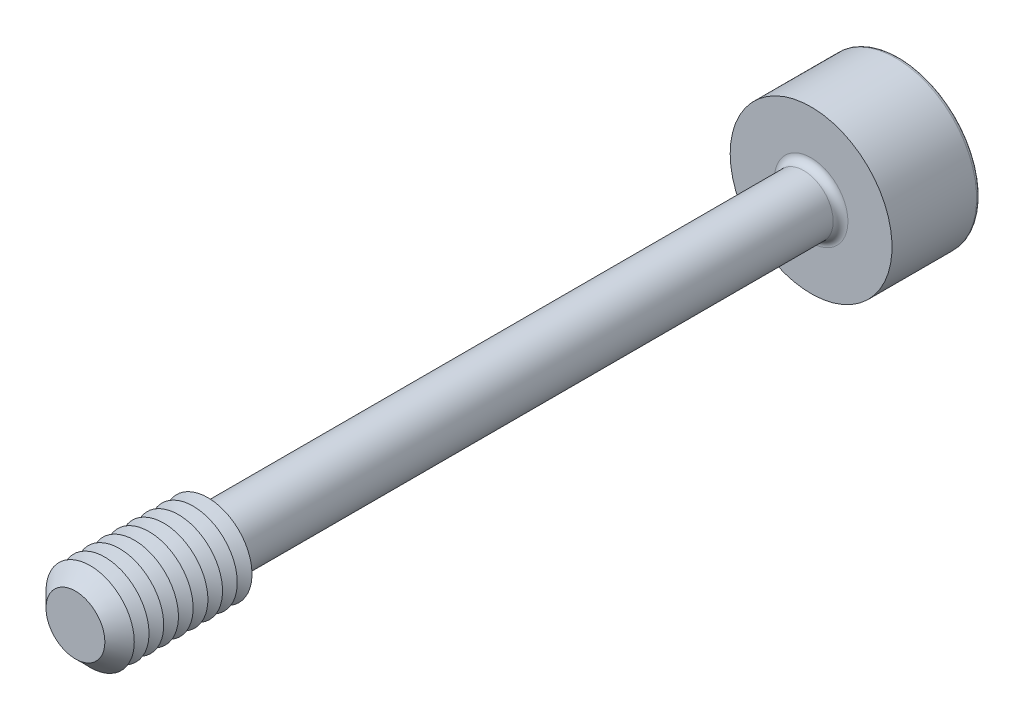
from build123d import *

# Parameters (mm, degrees)
SKETCH1_R       = 1
EXTRUDE1_DEPTH  = 12.5
CHAMFER1_SIZE   = 0.5
SKETCH3_R       = 2.75
EXTRUDE2_DEPTH  = 3
EXTRUDE3_DEPTH  = 2.5
FILLET1_R       = 0.25
FILLET2_R       = 0.125
LPATTERN1_COUNT = 8
LPATTERN1_PITCH = 0.5


with BuildPart() as part:
    # Sketch1 → Extrude1 (new, symmetric)
    with BuildSketch(Plane.XY):
        Circle(SKETCH1_R)
    extrude(amount=EXTRUDE1_DEPTH, both=True)

    # Sketch2 → Revolve1 (revolve)
    with BuildSketch(Plane(origin=(0, 0, 0), x_dir=(0, 0, -1), z_dir=(1, 0, 0))):
        Polygon((-12.5, 0), (-12.5, 1.5), (-8, 1.5), (-7.711324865, 1), (-7.711324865, 0), align=None)
    revolve(axis=Axis((0, 0, 7.711324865), (0, 0, 1)))

    # Chamfer1
    chamfer1_edges = [part.edges().sort_by_distance(p)[0] for p in [
        (0, -1.5, 12.5),
    ]]
    chamfer(chamfer1_edges, length=CHAMFER1_SIZE)

    # Sketch3 → Extrude2 (add)
    with BuildSketch(Plane(origin=(0, 0, -12.5), x_dir=(-1, 0, 0), z_dir=(0, 0, -1))):
        Circle(SKETCH3_R)
    extrude(amount=EXTRUDE2_DEPTH)

    # Sketch4 → Extrude3 (cut)
    with BuildSketch(Plane(origin=(-13.7, 0, -15.5), x_dir=(1, 0, 0), z_dir=(0, 0, 1))):
        Polygon((12.978312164, -1.25), (14.421687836, -1.25), (15.143375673, 0), (14.421687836, 1.25), (12.978312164, 1.25), (12.256624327, 0), align=None)
    extrude(amount=EXTRUDE3_DEPTH, mode=Mode.SUBTRACT)

    # Fillet1
    fillet1_edges = [part.edges().sort_by_distance(p)[0] for p in [
        (-1, 0, -12.5),
    ]]
    fillet(fillet1_edges, radius=FILLET1_R)

    # Fillet2
    fillet2_edges = [part.edges().sort_by_distance(p)[0] for p in [
        (2.75, 0, -15.5),
    ]]
    fillet(fillet2_edges, radius=FILLET2_R)

    # Sketch5 → Cut-Revolve1 (revolve, cut)
    with BuildSketch(Plane(origin=(0, 0, 0), x_dir=(0, 0, -1), z_dir=(1, 0, 0)), mode=Mode.PRIVATE) as cut_revolve1_sk:
        Polygon((13, 0), (13, -1.25), (12.278312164, 0), align=None)
    revolve(cut_revolve1_sk.sketch.rotate(Axis((0, 0, -12.278312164), (0, 0, -1)), 90), axis=Axis((0, 0, -12.278312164), (0, 0, -1)), mode=Mode.SUBTRACT)

    # Sketch7 → Cut-Revolve2 (revolve, cut)
    with BuildSketch(Plane(origin=(0, 0, 0), x_dir=(0, 0, -1), z_dir=(1, 0, 0)), mode=Mode.PRIVATE) as cut_revolve2_sk:
        Polygon((-8, 1.5), (-8.25, 1.066987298), (-8.5, 1.5), align=None)
    cut_revolve2 = revolve(cut_revolve2_sk.sketch.rotate(Axis((0, 0, -1.332048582), (0, 0, 1)), 90), axis=Axis((0, 0, -1.332048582), (0, 0, 1)), mode=Mode.SUBTRACT)

    # LPattern1: Cut-Revolve2 ×8
    with Locations(*[(0, 0, i * LPATTERN1_PITCH) for i in range(1, LPATTERN1_COUNT)]):
        add(cut_revolve2, mode=Mode.SUBTRACT)


solid = part.part
